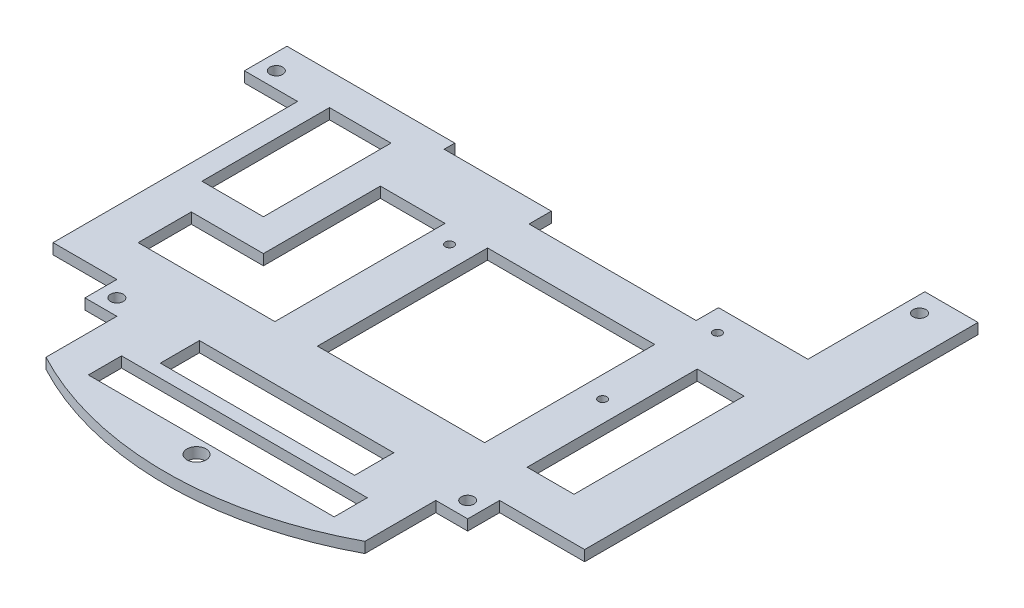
from build123d import *

# Parameters (mm, degrees)
SKIZZE1_R                       = 3
SKIZZE1_R_2                     = 4.5
SKIZZE1_R_3                     = 2
SKIZZE1_W                       = 91.4
SKIZZE1_H                       = 18.4
SKIZZE1_W_2                     = 115.6
SKIZZE1_H_2                     = 15.6
SKIZZE1_W_3                     = 22.045409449
SKIZZE1_H_3                     = 80
SKIZZE1_W_4                     = 28.929694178
SKIZZE1_H_4                     = 60
SKIZZE1_W_5                     = 78.62111105
AUFSATZ_LINEAR_AUSTRAGEN1_DEPTH = 5


with BuildPart() as part:
    # Skizze1 → Aufsatz-Linear austragen1 (new body)
    with BuildSketch(Plane(origin=(0, 0, 0), x_dir=(1, 0, 0), z_dir=(0, 1, 0))):
        with BuildLine():
            Line((-15.666520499, 37.5), (-66.070305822, 37.5))
            Line((-66.070305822, 37.5), (-66.070305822, 42.5))
            Line((-66.070305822, 42.5), (-145, 42.5))
            Line((-145, 42.5), (-145, 37.5))
            Line((-145, 37.5), (-145, 22.5))
            Line((-145, 22.5), (-120, 22.5))
            Line((-120, 22.5), (-120, -27.5))
            Line((-120, -27.5), (-120, -92.5))
            Line((-120, -92.5), (-90, -92.5))
            Line((-90, -92.5), (-90, -107.5))
            Line((-90, -107.5), (-75, -107.5))
            Line((-75, -107.5), (-75, -140.823471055))
            ThreePointArc((-75, -140.823471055), (0, -159.550148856), (75, -140.823471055))
            Line((75, -140.823471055), (75, -107.5))
            Line((75, -107.5), (90, -107.5))
            Line((90, -107.5), (90, -92.5))
            Line((90, -92.5), (130, -92.5))
            Line((130, -92.5), (130, 15))
            Line((130, 15), (130, 92.5))
            Line((130, 92.5), (105, 92.5))
            Line((105, 92.5), (105, 37.5))
            Line((105, 37.5), (62.954590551, 37.5))
            Line((62.954590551, 37.5), (62.954590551, 27))
            Line((62.954590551, 27), (-15.666520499, 27))
            Line((-15.666520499, 27), (-15.666520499, 37.5))
        make_face()
        with Locations(Location((-137.5, 30, 0), (0, 0, 270))):
            Circle(SKIZZE1_R, mode=Mode.SUBTRACT)
        with Locations(Location((82.5, -100, 0), (0, 0, 270))):
            Circle(SKIZZE1_R, mode=Mode.SUBTRACT)
        with Locations(Location((-82.5, -100, 0), (0, 0, 270))):
            Circle(SKIZZE1_R, mode=Mode.SUBTRACT)
        with Locations(Location((0, -145.026959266, 0), (0, 0, 270))):
            Circle(SKIZZE1_R_2, mode=Mode.SUBTRACT)
        with Locations(Location((112.5, 82.5, 0), (0, 0, 270))):
            Circle(SKIZZE1_R, mode=Mode.SUBTRACT)
        with Locations(Location((-26.043769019, 0, 0), (0, 0, 270))):
            Circle(SKIZZE1_R_3, mode=Mode.SUBTRACT)
        with Locations(Location((72.956230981, -27, 0), (0, 0, 270))):
            Circle(SKIZZE1_R_3, mode=Mode.SUBTRACT)
        with Locations(Location((72.956230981, 27, 0), (0, 0, 270))):
            Circle(SKIZZE1_R_3, mode=Mode.SUBTRACT)
        with Locations((0, -107.163021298)):
            Rectangle(SKIZZE1_W, SKIZZE1_H, mode=Mode.SUBTRACT)
        with Locations((0, -130.310637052)):
            Rectangle(SKIZZE1_W_2, SKIZZE1_H_2, mode=Mode.SUBTRACT)
        with Locations((93.977295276, -32.5)):
            Rectangle(SKIZZE1_W_3, SKIZZE1_H_3, mode=Mode.SUBTRACT)
        Polygon((-100, -47.5), (-100, -72.5), (-35.666520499, -72.5), (-35.666520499, 7.5), (-66.070305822, 7.5), (-66.070305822, -47.5), align=None, mode=Mode.SUBTRACT)
        with Locations((-95.535152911, -2.5)):
            Rectangle(SKIZZE1_W_4, SKIZZE1_H_4, mode=Mode.SUBTRACT)
        with Locations((23.644035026, -32.5)):
            Rectangle(SKIZZE1_W_5, SKIZZE1_H_3, mode=Mode.SUBTRACT)
    extrude(amount=AUFSATZ_LINEAR_AUSTRAGEN1_DEPTH)


solid = part.part
